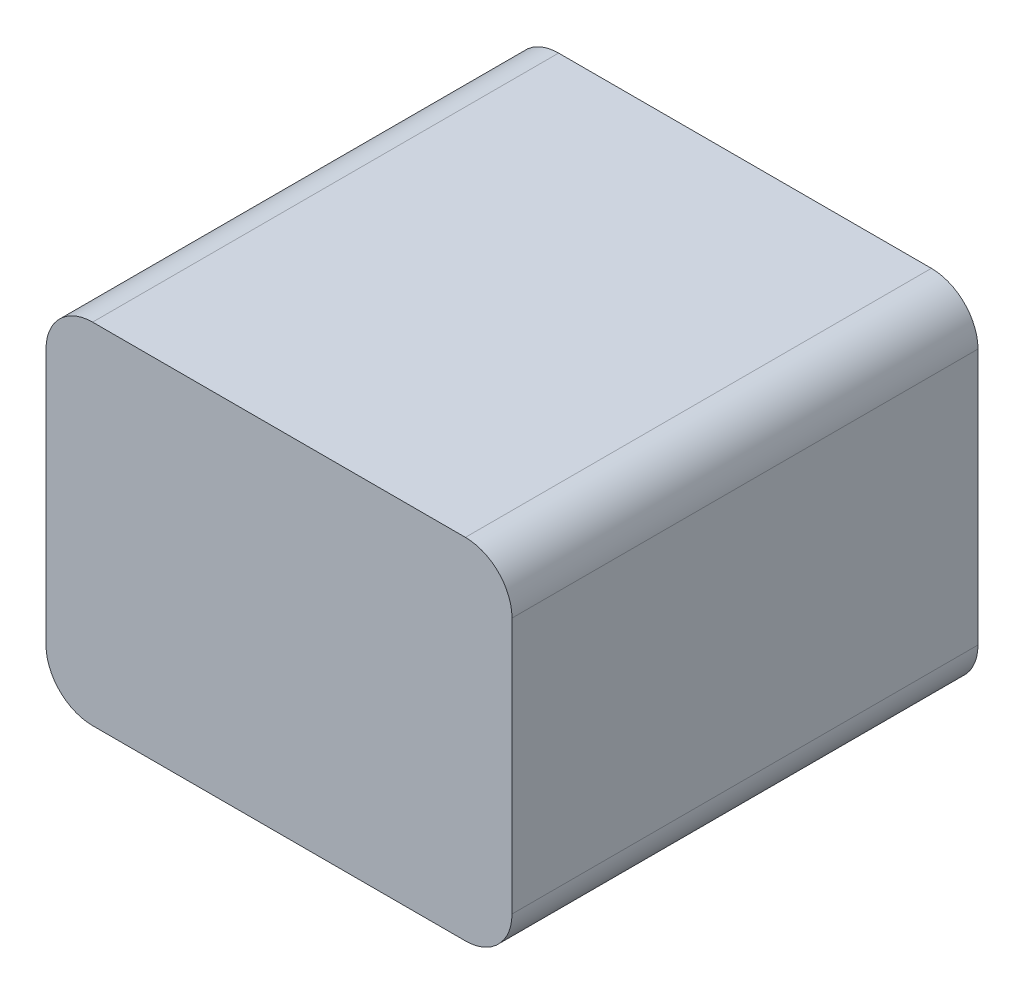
ISO-10303-21;
HEADER;
FILE_DESCRIPTION(('STEP AP214'),'2;1');
FILE_NAME('part.step','',(''),(''),'','','');
FILE_SCHEMA(('AUTOMOTIVE_DESIGN { 1 0 10303 214 1 1 1 1 }'));
ENDSEC;
DATA;
#1=APPLICATION_CONTEXT('core data for automotive mechanical design processes');
#2=APPLICATION_PROTOCOL_DEFINITION('international standard','automotive_design',2000,#1);
#3=PRODUCT_CONTEXT('',#1,'mechanical');
#4=PRODUCT('Part','Part','',(#3));
#5=PRODUCT_RELATED_PRODUCT_CATEGORY('part','',(#4));
#6=PRODUCT_DEFINITION_FORMATION('','',#4);
#7=PRODUCT_DEFINITION_CONTEXT('part definition',#1,'design');
#8=PRODUCT_DEFINITION('design','',#6,#7);
#9=PRODUCT_DEFINITION_SHAPE('','',#8);
#10=(LENGTH_UNIT() NAMED_UNIT(*) SI_UNIT(.MILLI.,.METRE.));
#11=(NAMED_UNIT(*) PLANE_ANGLE_UNIT() SI_UNIT($,.RADIAN.));
#12=(NAMED_UNIT(*) SI_UNIT($,.STERADIAN.) SOLID_ANGLE_UNIT());
#13=UNCERTAINTY_MEASURE_WITH_UNIT(LENGTH_MEASURE(1.E-05),#10,'distance_accuracy_value','');
#14=(GEOMETRIC_REPRESENTATION_CONTEXT(3) GLOBAL_UNCERTAINTY_ASSIGNED_CONTEXT((#13)) GLOBAL_UNIT_ASSIGNED_CONTEXT((#10,
#11,#12)) REPRESENTATION_CONTEXT('',''));
#15=CARTESIAN_POINT('',(0.,0.,0.));
#16=DIRECTION('',(0.,0.,1.));
#17=DIRECTION('',(1.,0.,0.));
#18=AXIS2_PLACEMENT_3D('',#15,#16,#17);
#19=CARTESIAN_POINT('',(-12.7,6.985,12.7));
#20=DIRECTION('',(1.,0.,0.));
#21=DIRECTION('',(0.,1.,0.));
#22=AXIS2_PLACEMENT_3D('',#19,#20,#21);
#23=PLANE('',#22);
#24=DIRECTION('',(0.,-1.,0.));
#25=VECTOR('',#24,1.);
#26=CARTESIAN_POINT('',(-12.7,6.985,-12.7));
#27=LINE('',#26,#25);
#28=CARTESIAN_POINT('',(-12.7,6.985,-12.7));
#29=VERTEX_POINT('',#28);
#30=CARTESIAN_POINT('',(-12.7,-6.985,-12.7));
#31=VERTEX_POINT('',#30);
#32=EDGE_CURVE('E356',#29,#31,#27,.T.);
#33=ORIENTED_EDGE('',*,*,#32,.T.);
#34=DIRECTION('',(0.,0.,-1.));
#35=VECTOR('',#34,1.);
#36=CARTESIAN_POINT('',(-12.7,-6.985,12.7));
#37=LINE('',#36,#35);
#38=CARTESIAN_POINT('',(-12.7,-6.985,12.7));
#39=VERTEX_POINT('',#38);
#40=EDGE_CURVE('E385',#39,#31,#37,.T.);
#41=ORIENTED_EDGE('',*,*,#40,.F.);
#42=DIRECTION('',(0.,-1.,0.));
#43=VECTOR('',#42,1.);
#44=CARTESIAN_POINT('',(-12.7,6.985,12.7));
#45=LINE('',#44,#43);
#46=CARTESIAN_POINT('',(-12.7,6.985,12.7));
#47=VERTEX_POINT('',#46);
#48=EDGE_CURVE('E331',#47,#39,#45,.T.);
#49=ORIENTED_EDGE('',*,*,#48,.F.);
#50=DIRECTION('',(0.,0.,-1.));
#51=VECTOR('',#50,1.);
#52=CARTESIAN_POINT('',(-12.7,6.985,12.7));
#53=LINE('',#52,#51);
#54=EDGE_CURVE('E389',#47,#29,#53,.T.);
#55=ORIENTED_EDGE('',*,*,#54,.T.);
#56=EDGE_LOOP('',(#33,#41,#49,#55));
#57=FACE_BOUND('',#56,.T.);
#58=DIRECTION('',(0.,1.,0.));
#59=VECTOR('',#58,1.);
#60=CARTESIAN_POINT('',(-12.7,3.81,8.89));
#61=LINE('',#60,#59);
#62=CARTESIAN_POINT('',(-12.7,-1.27,8.89));
#63=VERTEX_POINT('',#62);
#64=CARTESIAN_POINT('',(-12.7,1.27,8.89));
#65=VERTEX_POINT('',#64);
#66=EDGE_CURVE('E272',#63,#65,#61,.T.);
#67=ORIENTED_EDGE('',*,*,#66,.F.);
#68=CARTESIAN_POINT('',(-12.7,-1.27,6.35));
#69=DIRECTION('',(1.,0.,0.));
#70=DIRECTION('',(0.,1.,0.));
#71=AXIS2_PLACEMENT_3D('',#68,#69,#70);
#72=CIRCLE('',#71,2.54);
#73=CARTESIAN_POINT('',(-12.7,-3.81,6.35));
#74=VERTEX_POINT('',#73);
#75=EDGE_CURVE('E11',#63,#74,#72,.T.);
#76=ORIENTED_EDGE('',*,*,#75,.T.);
#77=DIRECTION('',(0.,0.,1.));
#78=VECTOR('',#77,1.);
#79=CARTESIAN_POINT('',(-12.7,-3.81,-8.89));
#80=LINE('',#79,#78);
#81=CARTESIAN_POINT('',(-12.7,-3.81,-6.35));
#82=VERTEX_POINT('',#81);
#83=EDGE_CURVE('E294',#82,#74,#80,.T.);
#84=ORIENTED_EDGE('',*,*,#83,.F.);
#85=CARTESIAN_POINT('',(-12.7,-1.27,-6.35));
#86=DIRECTION('',(1.,0.,0.));
#87=DIRECTION('',(0.,1.,0.));
#88=AXIS2_PLACEMENT_3D('',#85,#86,#87);
#89=CIRCLE('',#88,2.54);
#90=CARTESIAN_POINT('',(-12.7,-1.27,-8.89));
#91=VERTEX_POINT('',#90);
#92=EDGE_CURVE('E53',#82,#91,#89,.T.);
#93=ORIENTED_EDGE('',*,*,#92,.T.);
#94=DIRECTION('',(0.,-1.,0.));
#95=VECTOR('',#94,1.);
#96=CARTESIAN_POINT('',(-12.7,3.81,-8.89));
#97=LINE('',#96,#95);
#98=CARTESIAN_POINT('',(-12.7,1.27,-8.89));
#99=VERTEX_POINT('',#98);
#100=EDGE_CURVE('E314',#99,#91,#97,.T.);
#101=ORIENTED_EDGE('',*,*,#100,.F.);
#102=CARTESIAN_POINT('',(-12.7,1.27,-6.35));
#103=DIRECTION('',(1.,0.,0.));
#104=DIRECTION('',(0.,1.,0.));
#105=AXIS2_PLACEMENT_3D('',#102,#103,#104);
#106=CIRCLE('',#105,2.54);
#107=CARTESIAN_POINT('',(-12.7,3.81,-6.35));
#108=VERTEX_POINT('',#107);
#109=EDGE_CURVE('E441',#99,#108,#106,.T.);
#110=ORIENTED_EDGE('',*,*,#109,.T.);
#111=DIRECTION('',(0.,0.,-1.));
#112=VECTOR('',#111,1.);
#113=CARTESIAN_POINT('',(-12.7,3.81,-8.89));
#114=LINE('',#113,#112);
#115=CARTESIAN_POINT('',(-12.7,3.81,6.35));
#116=VERTEX_POINT('',#115);
#117=EDGE_CURVE('E310',#116,#108,#114,.T.);
#118=ORIENTED_EDGE('',*,*,#117,.F.);
#119=CARTESIAN_POINT('',(-12.7,1.27,6.35));
#120=DIRECTION('',(1.,0.,0.));
#121=DIRECTION('',(0.,1.,0.));
#122=AXIS2_PLACEMENT_3D('',#119,#120,#121);
#123=CIRCLE('',#122,2.54);
#124=EDGE_CURVE('E444',#116,#65,#123,.T.);
#125=ORIENTED_EDGE('',*,*,#124,.T.);
#126=EDGE_LOOP('',(#67,#76,#84,#93,#101,#110,#118,#125));
#127=FACE_BOUND('',#126,.T.);
#128=ADVANCED_FACE('F44',(#57,#127),#23,.F.);
#129=CARTESIAN_POINT('',(10.16,6.985,12.7));
#130=DIRECTION('',(0.,0.,-1.));
#131=DIRECTION('',(-1.,0.,0.));
#132=AXIS2_PLACEMENT_3D('',#129,#130,#131);
#133=CYLINDRICAL_SURFACE('',#132,2.54);
#134=CARTESIAN_POINT('',(10.16,6.985,-12.7));
#135=DIRECTION('',(0.,0.,1.));
#136=DIRECTION('',(-1.,0.,0.));
#137=AXIS2_PLACEMENT_3D('',#134,#135,#136);
#138=CIRCLE('',#137,2.54);
#139=CARTESIAN_POINT('',(12.7,6.985,-12.7));
#140=VERTEX_POINT('',#139);
#141=CARTESIAN_POINT('',(10.16,9.525,-12.7));
#142=VERTEX_POINT('',#141);
#143=EDGE_CURVE('E306',#140,#142,#138,.T.);
#144=ORIENTED_EDGE('',*,*,#143,.T.);
#145=DIRECTION('',(0.,0.,-1.));
#146=VECTOR('',#145,1.);
#147=CARTESIAN_POINT('',(10.16,9.525,12.7));
#148=LINE('',#147,#146);
#149=CARTESIAN_POINT('',(10.16,9.525,12.7));
#150=VERTEX_POINT('',#149);
#151=EDGE_CURVE('E397',#150,#142,#148,.T.);
#152=ORIENTED_EDGE('',*,*,#151,.F.);
#153=CARTESIAN_POINT('',(10.16,6.985,12.7));
#154=DIRECTION('',(0.,0.,1.));
#155=DIRECTION('',(-1.,0.,0.));
#156=AXIS2_PLACEMENT_3D('',#153,#154,#155);
#157=CIRCLE('',#156,2.54);
#158=CARTESIAN_POINT('',(12.7,6.985,12.7));
#159=VERTEX_POINT('',#158);
#160=EDGE_CURVE('E320',#159,#150,#157,.T.);
#161=ORIENTED_EDGE('',*,*,#160,.F.);
#162=DIRECTION('',(0.,0.,-1.));
#163=VECTOR('',#162,1.);
#164=CARTESIAN_POINT('',(12.7,6.985,12.7));
#165=LINE('',#164,#163);
#166=EDGE_CURVE('E346',#159,#140,#165,.T.);
#167=ORIENTED_EDGE('',*,*,#166,.T.);
#168=EDGE_LOOP('',(#144,#152,#161,#167));
#169=FACE_BOUND('',#168,.T.);
#170=ADVANCED_FACE('F494',(#169),#133,.T.);
#171=CARTESIAN_POINT('',(-10.16,9.525,12.7));
#172=DIRECTION('',(0.,-1.,0.));
#173=DIRECTION('',(0.,0.,-1.));
#174=AXIS2_PLACEMENT_3D('',#171,#172,#173);
#175=PLANE('',#174);
#176=DIRECTION('',(-1.,0.,0.));
#177=VECTOR('',#176,1.);
#178=CARTESIAN_POINT('',(-10.16,9.525,-12.7));
#179=LINE('',#178,#177);
#180=CARTESIAN_POINT('',(-10.16,9.525,-12.7));
#181=VERTEX_POINT('',#180);
#182=EDGE_CURVE('E350',#142,#181,#179,.T.);
#183=ORIENTED_EDGE('',*,*,#182,.T.);
#184=DIRECTION('',(0.,0.,-1.));
#185=VECTOR('',#184,1.);
#186=CARTESIAN_POINT('',(-10.16,9.525,12.7));
#187=LINE('',#186,#185);
#188=CARTESIAN_POINT('',(-10.16,9.525,12.7));
#189=VERTEX_POINT('',#188);
#190=EDGE_CURVE('E393',#189,#181,#187,.T.);
#191=ORIENTED_EDGE('',*,*,#190,.F.);
#192=DIRECTION('',(-1.,0.,0.));
#193=VECTOR('',#192,1.);
#194=CARTESIAN_POINT('',(-10.16,9.525,12.7));
#195=LINE('',#194,#193);
#196=EDGE_CURVE('E324',#150,#189,#195,.T.);
#197=ORIENTED_EDGE('',*,*,#196,.F.);
#198=ORIENTED_EDGE('',*,*,#151,.T.);
#199=EDGE_LOOP('',(#183,#191,#197,#198));
#200=FACE_BOUND('',#199,.T.);
#201=ADVANCED_FACE('F502',(#200),#175,.F.);
#202=CARTESIAN_POINT('',(-10.16,6.985,12.7));
#203=DIRECTION('',(0.,0.,-1.));
#204=DIRECTION('',(-1.,0.,0.));
#205=AXIS2_PLACEMENT_3D('',#202,#203,#204);
#206=CYLINDRICAL_SURFACE('',#205,2.54);
#207=CARTESIAN_POINT('',(-10.16,6.985,-12.7));
#208=DIRECTION('',(0.,0.,1.));
#209=DIRECTION('',(1.,0.,0.));
#210=AXIS2_PLACEMENT_3D('',#207,#208,#209);
#211=CIRCLE('',#210,2.54);
#212=EDGE_CURVE('E353',#181,#29,#211,.T.);
#213=ORIENTED_EDGE('',*,*,#212,.T.);
#214=ORIENTED_EDGE('',*,*,#54,.F.);
#215=CARTESIAN_POINT('',(-10.16,6.985,12.7));
#216=DIRECTION('',(0.,0.,1.));
#217=DIRECTION('',(1.,0.,0.));
#218=AXIS2_PLACEMENT_3D('',#215,#216,#217);
#219=CIRCLE('',#218,2.54);
#220=EDGE_CURVE('E328',#189,#47,#219,.T.);
#221=ORIENTED_EDGE('',*,*,#220,.F.);
#222=ORIENTED_EDGE('',*,*,#190,.T.);
#223=EDGE_LOOP('',(#213,#214,#221,#222));
#224=FACE_BOUND('',#223,.T.);
#225=ADVANCED_FACE('F508',(#224),#206,.T.);
#226=CARTESIAN_POINT('',(-10.16,-6.985,12.7));
#227=DIRECTION('',(0.,0.,-1.));
#228=DIRECTION('',(-1.,0.,0.));
#229=AXIS2_PLACEMENT_3D('',#226,#227,#228);
#230=CYLINDRICAL_SURFACE('',#229,2.54);
#231=CARTESIAN_POINT('',(-10.16,-6.985,-12.7));
#232=DIRECTION('',(0.,0.,1.));
#233=DIRECTION('',(1.,0.,0.));
#234=AXIS2_PLACEMENT_3D('',#231,#232,#233);
#235=CIRCLE('',#234,2.54);
#236=CARTESIAN_POINT('',(-10.16,-9.525,-12.7));
#237=VERTEX_POINT('',#236);
#238=EDGE_CURVE('E359',#31,#237,#235,.T.);
#239=ORIENTED_EDGE('',*,*,#238,.T.);
#240=DIRECTION('',(0.,0.,-1.));
#241=VECTOR('',#240,1.);
#242=CARTESIAN_POINT('',(-10.16,-9.525,12.7));
#243=LINE('',#242,#241);
#244=CARTESIAN_POINT('',(-10.16,-9.525,12.7));
#245=VERTEX_POINT('',#244);
#246=EDGE_CURVE('E381',#245,#237,#243,.T.);
#247=ORIENTED_EDGE('',*,*,#246,.F.);
#248=CARTESIAN_POINT('',(-10.16,-6.985,12.7));
#249=DIRECTION('',(0.,0.,1.));
#250=DIRECTION('',(1.,0.,0.));
#251=AXIS2_PLACEMENT_3D('',#248,#249,#250);
#252=CIRCLE('',#251,2.54);
#253=EDGE_CURVE('E334',#39,#245,#252,.T.);
#254=ORIENTED_EDGE('',*,*,#253,.F.);
#255=ORIENTED_EDGE('',*,*,#40,.T.);
#256=EDGE_LOOP('',(#239,#247,#254,#255));
#257=FACE_BOUND('',#256,.T.);
#258=ADVANCED_FACE('F506',(#257),#230,.T.);
#259=CARTESIAN_POINT('',(-10.16,-9.525,12.7));
#260=DIRECTION('',(0.,1.,0.));
#261=DIRECTION('',(0.,0.,1.));
#262=AXIS2_PLACEMENT_3D('',#259,#260,#261);
#263=PLANE('',#262);
#264=DIRECTION('',(1.,0.,0.));
#265=VECTOR('',#264,1.);
#266=CARTESIAN_POINT('',(-10.16,-9.525,-12.7));
#267=LINE('',#266,#265);
#268=CARTESIAN_POINT('',(10.16,-9.525,-12.7));
#269=VERTEX_POINT('',#268);
#270=EDGE_CURVE('E362',#237,#269,#267,.T.);
#271=ORIENTED_EDGE('',*,*,#270,.T.);
#272=DIRECTION('',(0.,0.,-1.));
#273=VECTOR('',#272,1.);
#274=CARTESIAN_POINT('',(10.16,-9.525,12.7));
#275=LINE('',#274,#273);
#276=CARTESIAN_POINT('',(10.16,-9.525,12.7));
#277=VERTEX_POINT('',#276);
#278=EDGE_CURVE('E377',#277,#269,#275,.T.);
#279=ORIENTED_EDGE('',*,*,#278,.F.);
#280=DIRECTION('',(1.,0.,0.));
#281=VECTOR('',#280,1.);
#282=CARTESIAN_POINT('',(-10.16,-9.525,12.7));
#283=LINE('',#282,#281);
#284=EDGE_CURVE('E337',#245,#277,#283,.T.);
#285=ORIENTED_EDGE('',*,*,#284,.F.);
#286=ORIENTED_EDGE('',*,*,#246,.T.);
#287=EDGE_LOOP('',(#271,#279,#285,#286));
#288=FACE_BOUND('',#287,.T.);
#289=ADVANCED_FACE('F548',(#288),#263,.F.);
#290=CARTESIAN_POINT('',(10.16,-6.985,12.7));
#291=DIRECTION('',(0.,0.,-1.));
#292=DIRECTION('',(-1.,0.,0.));
#293=AXIS2_PLACEMENT_3D('',#290,#291,#292);
#294=CYLINDRICAL_SURFACE('',#293,2.54);
#295=CARTESIAN_POINT('',(10.16,-6.985,-12.7));
#296=DIRECTION('',(0.,0.,1.));
#297=DIRECTION('',(1.,0.,0.));
#298=AXIS2_PLACEMENT_3D('',#295,#296,#297);
#299=CIRCLE('',#298,2.54);
#300=CARTESIAN_POINT('',(12.7,-6.985,-12.7));
#301=VERTEX_POINT('',#300);
#302=EDGE_CURVE('E365',#269,#301,#299,.T.);
#303=ORIENTED_EDGE('',*,*,#302,.T.);
#304=DIRECTION('',(0.,0.,-1.));
#305=VECTOR('',#304,1.);
#306=CARTESIAN_POINT('',(12.7,-6.985,12.7));
#307=LINE('',#306,#305);
#308=CARTESIAN_POINT('',(12.7,-6.985,12.7));
#309=VERTEX_POINT('',#308);
#310=EDGE_CURVE('E373',#309,#301,#307,.T.);
#311=ORIENTED_EDGE('',*,*,#310,.F.);
#312=CARTESIAN_POINT('',(10.16,-6.985,12.7));
#313=DIRECTION('',(0.,0.,1.));
#314=DIRECTION('',(1.,0.,0.));
#315=AXIS2_PLACEMENT_3D('',#312,#313,#314);
#316=CIRCLE('',#315,2.54);
#317=EDGE_CURVE('E340',#277,#309,#316,.T.);
#318=ORIENTED_EDGE('',*,*,#317,.F.);
#319=ORIENTED_EDGE('',*,*,#278,.T.);
#320=EDGE_LOOP('',(#303,#311,#318,#319));
#321=FACE_BOUND('',#320,.T.);
#322=ADVANCED_FACE('F546',(#321),#294,.T.);
#323=CARTESIAN_POINT('',(12.7,6.985,12.7));
#324=DIRECTION('',(-1.,0.,0.));
#325=DIRECTION('',(0.,-1.,0.));
#326=AXIS2_PLACEMENT_3D('',#323,#324,#325);
#327=PLANE('',#326);
#328=DIRECTION('',(0.,1.,0.));
#329=VECTOR('',#328,1.);
#330=CARTESIAN_POINT('',(12.7,6.985,-12.7));
#331=LINE('',#330,#329);
#332=EDGE_CURVE('E325',#301,#140,#331,.T.);
#333=ORIENTED_EDGE('',*,*,#332,.T.);
#334=ORIENTED_EDGE('',*,*,#166,.F.);
#335=DIRECTION('',(0.,1.,0.));
#336=VECTOR('',#335,1.);
#337=CARTESIAN_POINT('',(12.7,6.985,12.7));
#338=LINE('',#337,#336);
#339=EDGE_CURVE('E343',#309,#159,#338,.T.);
#340=ORIENTED_EDGE('',*,*,#339,.F.);
#341=ORIENTED_EDGE('',*,*,#310,.T.);
#342=EDGE_LOOP('',(#333,#334,#340,#341));
#343=FACE_BOUND('',#342,.T.);
#344=ADVANCED_FACE('F542',(#343),#327,.F.);
#345=CARTESIAN_POINT('',(10.16,6.985,12.7));
#346=DIRECTION('',(0.,0.,-1.));
#347=DIRECTION('',(-1.,0.,0.));
#348=AXIS2_PLACEMENT_3D('',#345,#346,#347);
#349=PLANE('',#348);
#350=ORIENTED_EDGE('',*,*,#160,.T.);
#351=ORIENTED_EDGE('',*,*,#196,.T.);
#352=ORIENTED_EDGE('',*,*,#220,.T.);
#353=ORIENTED_EDGE('',*,*,#48,.T.);
#354=ORIENTED_EDGE('',*,*,#253,.T.);
#355=ORIENTED_EDGE('',*,*,#284,.T.);
#356=ORIENTED_EDGE('',*,*,#317,.T.);
#357=ORIENTED_EDGE('',*,*,#339,.T.);
#358=EDGE_LOOP('',(#350,#351,#352,#353,#354,#355,#356,#357));
#359=FACE_BOUND('',#358,.T.);
#360=ADVANCED_FACE('F534',(#359),#349,.F.);
#361=CARTESIAN_POINT('',(10.16,6.985,-12.7));
#362=DIRECTION('',(0.,0.,-1.));
#363=DIRECTION('',(-1.,0.,0.));
#364=AXIS2_PLACEMENT_3D('',#361,#362,#363);
#365=PLANE('',#364);
#366=ORIENTED_EDGE('',*,*,#143,.F.);
#367=ORIENTED_EDGE('',*,*,#332,.F.);
#368=ORIENTED_EDGE('',*,*,#302,.F.);
#369=ORIENTED_EDGE('',*,*,#270,.F.);
#370=ORIENTED_EDGE('',*,*,#238,.F.);
#371=ORIENTED_EDGE('',*,*,#32,.F.);
#372=ORIENTED_EDGE('',*,*,#212,.F.);
#373=ORIENTED_EDGE('',*,*,#182,.F.);
#374=EDGE_LOOP('',(#366,#367,#368,#369,#370,#371,#372,#373));
#375=FACE_BOUND('',#374,.T.);
#376=ADVANCED_FACE('F524',(#375),#365,.T.);
#377=CARTESIAN_POINT('',(-13.97,3.81,8.89));
#378=DIRECTION('',(0.,0.,-1.));
#379=DIRECTION('',(-1.,0.,0.));
#380=AXIS2_PLACEMENT_3D('',#377,#378,#379);
#381=PLANE('',#380);
#382=ORIENTED_EDGE('',*,*,#66,.T.);
#383=DIRECTION('',(1.,0.,0.));
#384=VECTOR('',#383,1.);
#385=CARTESIAN_POINT('',(-13.97,1.27,8.89));
#386=LINE('',#385,#384);
#387=CARTESIAN_POINT('',(-13.97,1.27,8.89));
#388=VERTEX_POINT('',#387);
#389=EDGE_CURVE('E431',#65,#388,#386,.F.);
#390=ORIENTED_EDGE('',*,*,#389,.T.);
#391=DIRECTION('',(0.,1.,0.));
#392=VECTOR('',#391,1.);
#393=CARTESIAN_POINT('',(-13.97,3.81,8.89));
#394=LINE('',#393,#392);
#395=CARTESIAN_POINT('',(-13.97,-1.27,8.89));
#396=VERTEX_POINT('',#395);
#397=EDGE_CURVE('E289',#396,#388,#394,.T.);
#398=ORIENTED_EDGE('',*,*,#397,.F.);
#399=DIRECTION('',(1.,0.,0.));
#400=VECTOR('',#399,1.);
#401=CARTESIAN_POINT('',(-13.97,-1.27,8.89));
#402=LINE('',#401,#400);
#403=EDGE_CURVE('E427',#396,#63,#402,.T.);
#404=ORIENTED_EDGE('',*,*,#403,.T.);
#405=EDGE_LOOP('',(#382,#390,#398,#404));
#406=FACE_BOUND('',#405,.T.);
#407=ADVANCED_FACE('F469',(#406),#381,.F.);
#408=CARTESIAN_POINT('',(-13.97,3.81,-8.89));
#409=DIRECTION('',(0.,-1.,0.));
#410=DIRECTION('',(1.,0.,0.));
#411=AXIS2_PLACEMENT_3D('',#408,#409,#410);
#412=PLANE('',#411);
#413=ORIENTED_EDGE('',*,*,#117,.T.);
#414=DIRECTION('',(1.,0.,0.));
#415=VECTOR('',#414,1.);
#416=CARTESIAN_POINT('',(-13.97,3.81,-6.35));
#417=LINE('',#416,#415);
#418=CARTESIAN_POINT('',(-13.97,3.81,-6.35));
#419=VERTEX_POINT('',#418);
#420=EDGE_CURVE('E412',#108,#419,#417,.F.);
#421=ORIENTED_EDGE('',*,*,#420,.T.);
#422=DIRECTION('',(0.,0.,-1.));
#423=VECTOR('',#422,1.);
#424=CARTESIAN_POINT('',(-13.97,3.81,-8.89));
#425=LINE('',#424,#423);
#426=CARTESIAN_POINT('',(-13.97,3.81,6.35));
#427=VERTEX_POINT('',#426);
#428=EDGE_CURVE('E293',#427,#419,#425,.T.);
#429=ORIENTED_EDGE('',*,*,#428,.F.);
#430=DIRECTION('',(1.,0.,0.));
#431=VECTOR('',#430,1.);
#432=CARTESIAN_POINT('',(-13.97,3.81,6.35));
#433=LINE('',#432,#431);
#434=EDGE_CURVE('E408',#427,#116,#433,.T.);
#435=ORIENTED_EDGE('',*,*,#434,.T.);
#436=EDGE_LOOP('',(#413,#421,#429,#435));
#437=FACE_BOUND('',#436,.T.);
#438=ADVANCED_FACE('F477',(#437),#412,.F.);
#439=CARTESIAN_POINT('',(-13.97,3.81,-8.89));
#440=DIRECTION('',(0.,0.,1.));
#441=DIRECTION('',(0.,-1.,0.));
#442=AXIS2_PLACEMENT_3D('',#439,#440,#441);
#443=PLANE('',#442);
#444=DIRECTION('',(0.,-1.,0.));
#445=VECTOR('',#444,1.);
#446=CARTESIAN_POINT('',(-13.97,3.81,-8.89));
#447=LINE('',#446,#445);
#448=CARTESIAN_POINT('',(-13.97,1.27,-8.89));
#449=VERTEX_POINT('',#448);
#450=CARTESIAN_POINT('',(-13.97,-1.27,-8.89));
#451=VERTEX_POINT('',#450);
#452=EDGE_CURVE('E298',#449,#451,#447,.T.);
#453=ORIENTED_EDGE('',*,*,#452,.F.);
#454=DIRECTION('',(1.,0.,0.));
#455=VECTOR('',#454,1.);
#456=CARTESIAN_POINT('',(-13.97,1.27,-8.89));
#457=LINE('',#456,#455);
#458=EDGE_CURVE('E404',#449,#99,#457,.T.);
#459=ORIENTED_EDGE('',*,*,#458,.T.);
#460=ORIENTED_EDGE('',*,*,#100,.T.);
#461=DIRECTION('',(1.,0.,0.));
#462=VECTOR('',#461,1.);
#463=CARTESIAN_POINT('',(-13.97,-1.27,-8.89));
#464=LINE('',#463,#462);
#465=EDGE_CURVE('E401',#91,#451,#464,.F.);
#466=ORIENTED_EDGE('',*,*,#465,.T.);
#467=EDGE_LOOP('',(#453,#459,#460,#466));
#468=FACE_BOUND('',#467,.T.);
#469=ADVANCED_FACE('F453',(#468),#443,.F.);
#470=CARTESIAN_POINT('',(-13.97,-3.81,-8.89));
#471=DIRECTION('',(0.,1.,0.));
#472=DIRECTION('',(-1.,0.,0.));
#473=AXIS2_PLACEMENT_3D('',#470,#471,#472);
#474=PLANE('',#473);
#475=DIRECTION('',(0.,0.,1.));
#476=VECTOR('',#475,1.);
#477=CARTESIAN_POINT('',(-13.97,-3.81,-8.89));
#478=LINE('',#477,#476);
#479=CARTESIAN_POINT('',(-13.97,-3.81,-6.35));
#480=VERTEX_POINT('',#479);
#481=CARTESIAN_POINT('',(-13.97,-3.81,6.35));
#482=VERTEX_POINT('',#481);
#483=EDGE_CURVE('E302',#480,#482,#478,.T.);
#484=ORIENTED_EDGE('',*,*,#483,.F.);
#485=DIRECTION('',(1.,0.,0.));
#486=VECTOR('',#485,1.);
#487=CARTESIAN_POINT('',(-13.97,-3.81,-6.35));
#488=LINE('',#487,#486);
#489=EDGE_CURVE('E437',#480,#82,#488,.T.);
#490=ORIENTED_EDGE('',*,*,#489,.T.);
#491=ORIENTED_EDGE('',*,*,#83,.T.);
#492=DIRECTION('',(1.,0.,0.));
#493=VECTOR('',#492,1.);
#494=CARTESIAN_POINT('',(-13.97,-3.81,6.35));
#495=LINE('',#494,#493);
#496=EDGE_CURVE('E434',#74,#482,#495,.F.);
#497=ORIENTED_EDGE('',*,*,#496,.T.);
#498=EDGE_LOOP('',(#484,#490,#491,#497));
#499=FACE_BOUND('',#498,.T.);
#500=ADVANCED_FACE('F462',(#499),#474,.F.);
#501=CARTESIAN_POINT('',(-13.97,0.,0.));
#502=DIRECTION('',(-1.,0.,0.));
#503=DIRECTION('',(0.,-1.,0.));
#504=AXIS2_PLACEMENT_3D('',#501,#502,#503);
#505=PLANE('',#504);
#506=DIRECTION('',(0.,0.,-1.));
#507=VECTOR('',#506,1.);
#508=CARTESIAN_POINT('',(-13.97,1.27,-8.89));
#509=LINE('',#508,#507);
#510=CARTESIAN_POINT('',(-13.97,1.27,6.35));
#511=VERTEX_POINT('',#510);
#512=CARTESIAN_POINT('',(-13.97,1.27,-6.35));
#513=VERTEX_POINT('',#512);
#514=EDGE_CURVE('E281',#511,#513,#509,.T.);
#515=ORIENTED_EDGE('',*,*,#514,.F.);
#516=DIRECTION('',(0.,1.,0.));
#517=VECTOR('',#516,1.);
#518=CARTESIAN_POINT('',(-13.97,3.81,6.35));
#519=LINE('',#518,#517);
#520=CARTESIAN_POINT('',(-13.97,-1.27,6.35));
#521=VERTEX_POINT('',#520);
#522=EDGE_CURVE('E277',#521,#511,#519,.T.);
#523=ORIENTED_EDGE('',*,*,#522,.F.);
#524=DIRECTION('',(0.,0.,1.));
#525=VECTOR('',#524,1.);
#526=CARTESIAN_POINT('',(-13.97,-1.27,-8.89));
#527=LINE('',#526,#525);
#528=CARTESIAN_POINT('',(-13.97,-1.27,-6.35));
#529=VERTEX_POINT('',#528);
#530=EDGE_CURVE('E60',#529,#521,#527,.T.);
#531=ORIENTED_EDGE('',*,*,#530,.F.);
#532=DIRECTION('',(0.,-1.,0.));
#533=VECTOR('',#532,1.);
#534=CARTESIAN_POINT('',(-13.97,3.81,-6.35));
#535=LINE('',#534,#533);
#536=EDGE_CURVE('E237',#513,#529,#535,.T.);
#537=ORIENTED_EDGE('',*,*,#536,.F.);
#538=EDGE_LOOP('',(#515,#523,#531,#537));
#539=FACE_BOUND('',#538,.T.);
#540=ORIENTED_EDGE('',*,*,#428,.T.);
#541=CARTESIAN_POINT('',(-13.97,1.27,-6.35));
#542=DIRECTION('',(-1.,0.,0.));
#543=DIRECTION('',(0.,-1.,0.));
#544=AXIS2_PLACEMENT_3D('',#541,#542,#543);
#545=CIRCLE('',#544,2.54);
#546=EDGE_CURVE('E424',#419,#449,#545,.T.);
#547=ORIENTED_EDGE('',*,*,#546,.T.);
#548=ORIENTED_EDGE('',*,*,#452,.T.);
#549=CARTESIAN_POINT('',(-13.97,-1.27,-6.35));
#550=DIRECTION('',(-1.,0.,0.));
#551=DIRECTION('',(0.,-1.,0.));
#552=AXIS2_PLACEMENT_3D('',#549,#550,#551);
#553=CIRCLE('',#552,2.54);
#554=EDGE_CURVE('E418',#451,#480,#553,.T.);
#555=ORIENTED_EDGE('',*,*,#554,.T.);
#556=ORIENTED_EDGE('',*,*,#483,.T.);
#557=CARTESIAN_POINT('',(-13.97,-1.27,6.35));
#558=DIRECTION('',(-1.,0.,0.));
#559=DIRECTION('',(0.,-1.,0.));
#560=AXIS2_PLACEMENT_3D('',#557,#558,#559);
#561=CIRCLE('',#560,2.54);
#562=EDGE_CURVE('E415',#482,#396,#561,.T.);
#563=ORIENTED_EDGE('',*,*,#562,.T.);
#564=ORIENTED_EDGE('',*,*,#397,.T.);
#565=CARTESIAN_POINT('',(-13.97,1.27,6.35));
#566=DIRECTION('',(-1.,0.,0.));
#567=DIRECTION('',(0.,-1.,0.));
#568=AXIS2_PLACEMENT_3D('',#565,#566,#567);
#569=CIRCLE('',#568,2.54);
#570=EDGE_CURVE('E421',#388,#427,#569,.T.);
#571=ORIENTED_EDGE('',*,*,#570,.T.);
#572=EDGE_LOOP('',(#540,#547,#548,#555,#556,#563,#564,#571));
#573=FACE_BOUND('',#572,.T.);
#574=ADVANCED_FACE('F459',(#539,#573),#505,.T.);
#575=CARTESIAN_POINT('',(-13.97,1.27,-6.35));
#576=DIRECTION('',(1.,0.,0.));
#577=DIRECTION('',(0.,1.,0.));
#578=AXIS2_PLACEMENT_3D('',#575,#576,#577);
#579=CYLINDRICAL_SURFACE('',#578,2.54);
#580=ORIENTED_EDGE('',*,*,#546,.F.);
#581=ORIENTED_EDGE('',*,*,#420,.F.);
#582=ORIENTED_EDGE('',*,*,#109,.F.);
#583=ORIENTED_EDGE('',*,*,#458,.F.);
#584=EDGE_LOOP('',(#580,#581,#582,#583));
#585=FACE_BOUND('',#584,.T.);
#586=ADVANCED_FACE('F481',(#585),#579,.T.);
#587=CARTESIAN_POINT('',(-13.97,1.27,6.35));
#588=DIRECTION('',(1.,0.,0.));
#589=DIRECTION('',(0.,1.,0.));
#590=AXIS2_PLACEMENT_3D('',#587,#588,#589);
#591=CYLINDRICAL_SURFACE('',#590,2.54);
#592=ORIENTED_EDGE('',*,*,#570,.F.);
#593=ORIENTED_EDGE('',*,*,#389,.F.);
#594=ORIENTED_EDGE('',*,*,#124,.F.);
#595=ORIENTED_EDGE('',*,*,#434,.F.);
#596=EDGE_LOOP('',(#592,#593,#594,#595));
#597=FACE_BOUND('',#596,.T.);
#598=ADVANCED_FACE('F472',(#597),#591,.T.);
#599=CARTESIAN_POINT('',(-13.97,-1.27,-6.35));
#600=DIRECTION('',(1.,0.,0.));
#601=DIRECTION('',(0.,1.,0.));
#602=AXIS2_PLACEMENT_3D('',#599,#600,#601);
#603=CYLINDRICAL_SURFACE('',#602,2.54);
#604=ORIENTED_EDGE('',*,*,#554,.F.);
#605=ORIENTED_EDGE('',*,*,#465,.F.);
#606=ORIENTED_EDGE('',*,*,#92,.F.);
#607=ORIENTED_EDGE('',*,*,#489,.F.);
#608=EDGE_LOOP('',(#604,#605,#606,#607));
#609=FACE_BOUND('',#608,.T.);
#610=ADVANCED_FACE('F456',(#609),#603,.T.);
#611=CARTESIAN_POINT('',(-13.97,-1.27,6.35));
#612=DIRECTION('',(1.,0.,0.));
#613=DIRECTION('',(0.,1.,0.));
#614=AXIS2_PLACEMENT_3D('',#611,#612,#613);
#615=CYLINDRICAL_SURFACE('',#614,2.54);
#616=ORIENTED_EDGE('',*,*,#562,.F.);
#617=ORIENTED_EDGE('',*,*,#496,.F.);
#618=ORIENTED_EDGE('',*,*,#75,.F.);
#619=ORIENTED_EDGE('',*,*,#403,.F.);
#620=EDGE_LOOP('',(#616,#617,#618,#619));
#621=FACE_BOUND('',#620,.T.);
#622=ADVANCED_FACE('F46',(#621),#615,.T.);
#623=CARTESIAN_POINT('',(-10.16,6.985,12.7));
#624=DIRECTION('',(1.,0.,0.));
#625=DIRECTION('',(0.,1.,0.));
#626=AXIS2_PLACEMENT_3D('',#623,#624,#625);
#627=PLANE('',#626);
#628=DIRECTION('',(0.,-1.,0.));
#629=VECTOR('',#628,1.);
#630=CARTESIAN_POINT('',(-10.16,6.985,-10.16));
#631=LINE('',#630,#629);
#632=CARTESIAN_POINT('',(-10.16,6.985,-10.16));
#633=VERTEX_POINT('',#632);
#634=CARTESIAN_POINT('',(-10.16,-6.985,-10.16));
#635=VERTEX_POINT('',#634);
#636=EDGE_CURVE('E207',#633,#635,#631,.T.);
#637=ORIENTED_EDGE('',*,*,#636,.F.);
#638=DIRECTION('',(0.,0.,-1.));
#639=VECTOR('',#638,1.);
#640=CARTESIAN_POINT('',(-10.16,6.985,12.7));
#641=LINE('',#640,#639);
#642=CARTESIAN_POINT('',(-10.16,6.985,10.16));
#643=VERTEX_POINT('',#642);
#644=EDGE_CURVE('E212',#643,#633,#641,.T.);
#645=ORIENTED_EDGE('',*,*,#644,.F.);
#646=DIRECTION('',(0.,-1.,0.));
#647=VECTOR('',#646,1.);
#648=CARTESIAN_POINT('',(-10.16,6.985,10.16));
#649=LINE('',#648,#647);
#650=CARTESIAN_POINT('',(-10.16,-6.985,10.16));
#651=VERTEX_POINT('',#650);
#652=EDGE_CURVE('E245',#643,#651,#649,.T.);
#653=ORIENTED_EDGE('',*,*,#652,.T.);
#654=DIRECTION('',(0.,0.,-1.));
#655=VECTOR('',#654,1.);
#656=CARTESIAN_POINT('',(-10.16,-6.985,12.7));
#657=LINE('',#656,#655);
#658=EDGE_CURVE('E214',#651,#635,#657,.T.);
#659=ORIENTED_EDGE('',*,*,#658,.T.);
#660=EDGE_LOOP('',(#637,#645,#653,#659));
#661=FACE_BOUND('',#660,.T.);
#662=DIRECTION('',(0.,1.,0.));
#663=VECTOR('',#662,1.);
#664=CARTESIAN_POINT('',(-10.16,6.985,6.35));
#665=LINE('',#664,#663);
#666=CARTESIAN_POINT('',(-10.16,-1.27,6.35));
#667=VERTEX_POINT('',#666);
#668=CARTESIAN_POINT('',(-10.16,1.27,6.35));
#669=VERTEX_POINT('',#668);
#670=EDGE_CURVE('E772',#667,#669,#665,.T.);
#671=ORIENTED_EDGE('',*,*,#670,.T.);
#672=DIRECTION('',(0.,0.,-1.));
#673=VECTOR('',#672,1.);
#674=CARTESIAN_POINT('',(-10.16,1.27,12.7));
#675=LINE('',#674,#673);
#676=CARTESIAN_POINT('',(-10.16,1.27,-6.35));
#677=VERTEX_POINT('',#676);
#678=EDGE_CURVE('E241',#669,#677,#675,.T.);
#679=ORIENTED_EDGE('',*,*,#678,.T.);
#680=DIRECTION('',(0.,-1.,0.));
#681=VECTOR('',#680,1.);
#682=CARTESIAN_POINT('',(-10.16,6.985,-6.35));
#683=LINE('',#682,#681);
#684=CARTESIAN_POINT('',(-10.16,-1.27,-6.35));
#685=VERTEX_POINT('',#684);
#686=EDGE_CURVE('E776',#677,#685,#683,.T.);
#687=ORIENTED_EDGE('',*,*,#686,.T.);
#688=DIRECTION('',(0.,0.,1.));
#689=VECTOR('',#688,1.);
#690=CARTESIAN_POINT('',(-10.16,-1.27,12.7));
#691=LINE('',#690,#689);
#692=EDGE_CURVE('E282',#685,#667,#691,.T.);
#693=ORIENTED_EDGE('',*,*,#692,.T.);
#694=EDGE_LOOP('',(#671,#679,#687,#693));
#695=FACE_BOUND('',#694,.T.);
#696=ADVANCED_FACE('F209',(#661,#695),#627,.T.);
#697=CARTESIAN_POINT('',(-10.16,6.985,12.7));
#698=DIRECTION('',(0.,-1.,0.));
#699=DIRECTION('',(0.,0.,-1.));
#700=AXIS2_PLACEMENT_3D('',#697,#698,#699);
#701=PLANE('',#700);
#702=DIRECTION('',(-1.,0.,0.));
#703=VECTOR('',#702,1.);
#704=CARTESIAN_POINT('',(10.16,6.985,-10.16));
#705=LINE('',#704,#703);
#706=CARTESIAN_POINT('',(10.16,6.985,-10.16));
#707=VERTEX_POINT('',#706);
#708=EDGE_CURVE('E220',#707,#633,#705,.T.);
#709=ORIENTED_EDGE('',*,*,#708,.F.);
#710=DIRECTION('',(0.,0.,-1.));
#711=VECTOR('',#710,1.);
#712=CARTESIAN_POINT('',(10.16,6.985,12.7));
#713=LINE('',#712,#711);
#714=CARTESIAN_POINT('',(10.16,6.985,10.16));
#715=VERTEX_POINT('',#714);
#716=EDGE_CURVE('E230',#715,#707,#713,.T.);
#717=ORIENTED_EDGE('',*,*,#716,.F.);
#718=DIRECTION('',(-1.,0.,0.));
#719=VECTOR('',#718,1.);
#720=CARTESIAN_POINT('',(10.16,6.985,10.16));
#721=LINE('',#720,#719);
#722=EDGE_CURVE('E228',#715,#643,#721,.T.);
#723=ORIENTED_EDGE('',*,*,#722,.T.);
#724=ORIENTED_EDGE('',*,*,#644,.T.);
#725=EDGE_LOOP('',(#709,#717,#723,#724));
#726=FACE_BOUND('',#725,.T.);
#727=ADVANCED_FACE('F225',(#726),#701,.T.);
#728=CARTESIAN_POINT('',(-10.16,-6.985,12.7));
#729=DIRECTION('',(0.,1.,0.));
#730=DIRECTION('',(0.,0.,1.));
#731=AXIS2_PLACEMENT_3D('',#728,#729,#730);
#732=PLANE('',#731);
#733=DIRECTION('',(1.,0.,0.));
#734=VECTOR('',#733,1.);
#735=CARTESIAN_POINT('',(10.16,-6.985,-10.16));
#736=LINE('',#735,#734);
#737=CARTESIAN_POINT('',(10.16,-6.985,-10.16));
#738=VERTEX_POINT('',#737);
#739=EDGE_CURVE('E219',#635,#738,#736,.T.);
#740=ORIENTED_EDGE('',*,*,#739,.F.);
#741=ORIENTED_EDGE('',*,*,#658,.F.);
#742=DIRECTION('',(1.,0.,0.));
#743=VECTOR('',#742,1.);
#744=CARTESIAN_POINT('',(10.16,-6.985,10.16));
#745=LINE('',#744,#743);
#746=CARTESIAN_POINT('',(10.16,-6.985,10.16));
#747=VERTEX_POINT('',#746);
#748=EDGE_CURVE('E256',#651,#747,#745,.T.);
#749=ORIENTED_EDGE('',*,*,#748,.T.);
#750=DIRECTION('',(0.,0.,-1.));
#751=VECTOR('',#750,1.);
#752=CARTESIAN_POINT('',(10.16,-6.985,12.7));
#753=LINE('',#752,#751);
#754=EDGE_CURVE('E255',#747,#738,#753,.T.);
#755=ORIENTED_EDGE('',*,*,#754,.T.);
#756=EDGE_LOOP('',(#740,#741,#749,#755));
#757=FACE_BOUND('',#756,.T.);
#758=ADVANCED_FACE('F591',(#757),#732,.T.);
#759=CARTESIAN_POINT('',(10.16,6.985,12.7));
#760=DIRECTION('',(-1.,0.,0.));
#761=DIRECTION('',(0.,-1.,0.));
#762=AXIS2_PLACEMENT_3D('',#759,#760,#761);
#763=PLANE('',#762);
#764=DIRECTION('',(0.,1.,0.));
#765=VECTOR('',#764,1.);
#766=CARTESIAN_POINT('',(10.16,6.985,-10.16));
#767=LINE('',#766,#765);
#768=EDGE_CURVE('E233',#738,#707,#767,.T.);
#769=ORIENTED_EDGE('',*,*,#768,.F.);
#770=ORIENTED_EDGE('',*,*,#754,.F.);
#771=DIRECTION('',(0.,1.,0.));
#772=VECTOR('',#771,1.);
#773=CARTESIAN_POINT('',(10.16,6.985,10.16));
#774=LINE('',#773,#772);
#775=EDGE_CURVE('E251',#747,#715,#774,.T.);
#776=ORIENTED_EDGE('',*,*,#775,.T.);
#777=ORIENTED_EDGE('',*,*,#716,.T.);
#778=EDGE_LOOP('',(#769,#770,#776,#777));
#779=FACE_BOUND('',#778,.T.);
#780=ADVANCED_FACE('F587',(#779),#763,.T.);
#781=CARTESIAN_POINT('',(10.16,6.985,10.16));
#782=DIRECTION('',(0.,0.,-1.));
#783=DIRECTION('',(-1.,0.,0.));
#784=AXIS2_PLACEMENT_3D('',#781,#782,#783);
#785=PLANE('',#784);
#786=ORIENTED_EDGE('',*,*,#775,.F.);
#787=ORIENTED_EDGE('',*,*,#748,.F.);
#788=ORIENTED_EDGE('',*,*,#652,.F.);
#789=ORIENTED_EDGE('',*,*,#722,.F.);
#790=EDGE_LOOP('',(#786,#787,#788,#789));
#791=FACE_BOUND('',#790,.T.);
#792=ADVANCED_FACE('F584',(#791),#785,.T.);
#793=CARTESIAN_POINT('',(10.16,6.985,-10.16));
#794=DIRECTION('',(0.,0.,-1.));
#795=DIRECTION('',(-1.,0.,0.));
#796=AXIS2_PLACEMENT_3D('',#793,#794,#795);
#797=PLANE('',#796);
#798=ORIENTED_EDGE('',*,*,#708,.T.);
#799=ORIENTED_EDGE('',*,*,#636,.T.);
#800=ORIENTED_EDGE('',*,*,#739,.T.);
#801=ORIENTED_EDGE('',*,*,#768,.T.);
#802=EDGE_LOOP('',(#798,#799,#800,#801));
#803=FACE_BOUND('',#802,.T.);
#804=ADVANCED_FACE('F232',(#803),#797,.F.);
#805=CARTESIAN_POINT('',(-13.97,3.81,6.35));
#806=DIRECTION('',(0.,0.,-1.));
#807=DIRECTION('',(-1.,0.,0.));
#808=AXIS2_PLACEMENT_3D('',#805,#806,#807);
#809=PLANE('',#808);
#810=ORIENTED_EDGE('',*,*,#670,.F.);
#811=DIRECTION('',(-1.,0.,0.));
#812=VECTOR('',#811,1.);
#813=CARTESIAN_POINT('',(-13.97,-1.27,6.35));
#814=LINE('',#813,#812);
#815=EDGE_CURVE('E268',#667,#521,#814,.T.);
#816=ORIENTED_EDGE('',*,*,#815,.T.);
#817=ORIENTED_EDGE('',*,*,#522,.T.);
#818=DIRECTION('',(-1.,0.,0.));
#819=VECTOR('',#818,1.);
#820=CARTESIAN_POINT('',(-13.97,1.27,6.35));
#821=LINE('',#820,#819);
#822=EDGE_CURVE('E265',#669,#511,#821,.T.);
#823=ORIENTED_EDGE('',*,*,#822,.F.);
#824=EDGE_LOOP('',(#810,#816,#817,#823));
#825=FACE_BOUND('',#824,.T.);
#826=ADVANCED_FACE('F577',(#825),#809,.T.);
#827=CARTESIAN_POINT('',(-13.97,1.27,-8.89));
#828=DIRECTION('',(0.,-1.,0.));
#829=DIRECTION('',(1.,0.,0.));
#830=AXIS2_PLACEMENT_3D('',#827,#828,#829);
#831=PLANE('',#830);
#832=ORIENTED_EDGE('',*,*,#678,.F.);
#833=ORIENTED_EDGE('',*,*,#822,.T.);
#834=ORIENTED_EDGE('',*,*,#514,.T.);
#835=DIRECTION('',(-1.,0.,0.));
#836=VECTOR('',#835,1.);
#837=CARTESIAN_POINT('',(-13.97,1.27,-6.35));
#838=LINE('',#837,#836);
#839=EDGE_CURVE('E269',#677,#513,#838,.T.);
#840=ORIENTED_EDGE('',*,*,#839,.F.);
#841=EDGE_LOOP('',(#832,#833,#834,#840));
#842=FACE_BOUND('',#841,.T.);
#843=ADVANCED_FACE('F573',(#842),#831,.T.);
#844=CARTESIAN_POINT('',(-13.97,3.81,-6.35));
#845=DIRECTION('',(0.,0.,1.));
#846=DIRECTION('',(0.,-1.,0.));
#847=AXIS2_PLACEMENT_3D('',#844,#845,#846);
#848=PLANE('',#847);
#849=ORIENTED_EDGE('',*,*,#536,.T.);
#850=DIRECTION('',(-1.,0.,0.));
#851=VECTOR('',#850,1.);
#852=CARTESIAN_POINT('',(-13.97,-1.27,-6.35));
#853=LINE('',#852,#851);
#854=EDGE_CURVE('E248',#685,#529,#853,.T.);
#855=ORIENTED_EDGE('',*,*,#854,.F.);
#856=ORIENTED_EDGE('',*,*,#686,.F.);
#857=ORIENTED_EDGE('',*,*,#839,.T.);
#858=EDGE_LOOP('',(#849,#855,#856,#857));
#859=FACE_BOUND('',#858,.T.);
#860=ADVANCED_FACE('F570',(#859),#848,.T.);
#861=CARTESIAN_POINT('',(-13.97,-1.27,-8.89));
#862=DIRECTION('',(0.,1.,0.));
#863=DIRECTION('',(-1.,0.,0.));
#864=AXIS2_PLACEMENT_3D('',#861,#862,#863);
#865=PLANE('',#864);
#866=ORIENTED_EDGE('',*,*,#530,.T.);
#867=ORIENTED_EDGE('',*,*,#815,.F.);
#868=ORIENTED_EDGE('',*,*,#692,.F.);
#869=ORIENTED_EDGE('',*,*,#854,.T.);
#870=EDGE_LOOP('',(#866,#867,#868,#869));
#871=FACE_BOUND('',#870,.T.);
#872=ADVANCED_FACE('F567',(#871),#865,.T.);
#873=CLOSED_SHELL('',(#128,#170,#201,#225,#258,#289,#322,#344,#360,#376,#407,#438,#469,#500,
#574,#586,#598,#610,#622,#696,#727,#758,#780,#792,#804,#826,#843,#860,#872));
#874=MANIFOLD_SOLID_BREP('B2',#873);
#875=ADVANCED_BREP_SHAPE_REPRESENTATION('',(#18,#874),#14);
#876=SHAPE_DEFINITION_REPRESENTATION(#9,#875);
ENDSEC;
END-ISO-10303-21;
